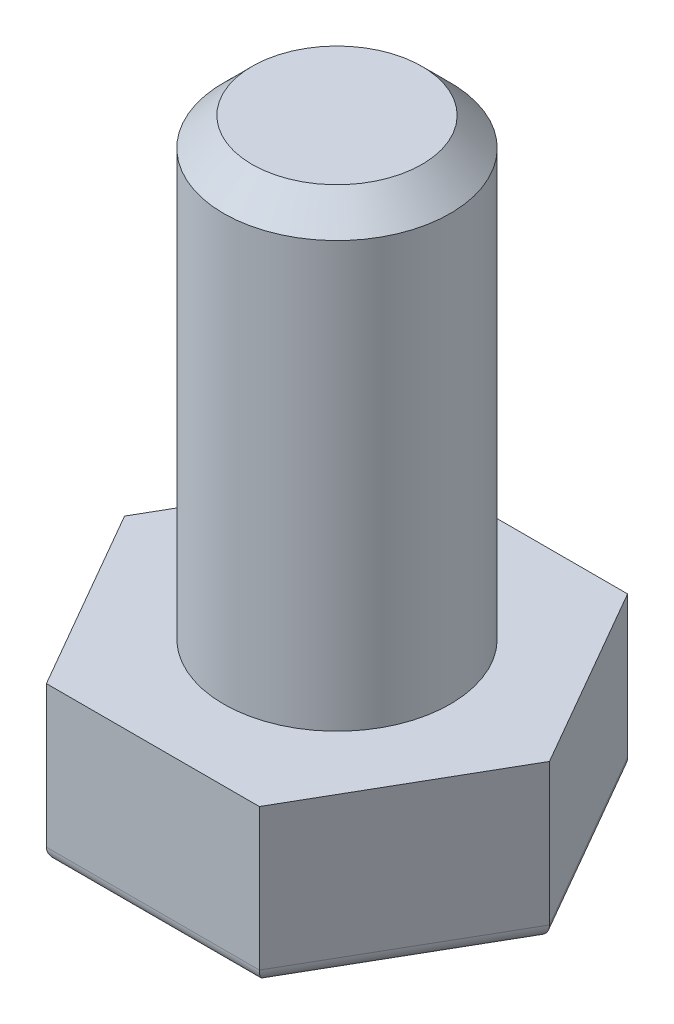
from build123d import *

# Parameters (mm, degrees)
EXTRUSION1_DEPTH = 5.5
CONG_1_R         = 0.5
ESQUISSE2_R      = 4
EXTRUSION2_DEPTH = 16
CHANFREIN1_SIZE  = 1


with BuildPart() as part:
    # Esquisse1 → Extrusion1 (new body)
    with BuildSketch(Plane(origin=(0, 0, 0), x_dir=(1, 0, 0), z_dir=(0, 1, 0))):
        Polygon((-3.758342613, 6.5), (3.758342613, 6.5), (7.5, 0), (3.758342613, -6.5), (-3.758342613, -6.5), (-7.5, 0), align=None)
    extrude(amount=EXTRUSION1_DEPTH)

    # Cong_1
    cong_1_edges = [part.edges().sort_by_distance(p)[0] for p in [
        (-5.629171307, 0, 3.25),
        (-5.629171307, 0, -3.25),
        (0, 0, -6.5),
        (5.629171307, 0, -3.25),
        (5.629171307, 0, 3.25),
        (0, 0, 6.5),
    ]]
    fillet(cong_1_edges, radius=CONG_1_R)

    # Esquisse2 → Extrusion2 (add)
    with BuildSketch(Plane(origin=(0, 5.5, 0), x_dir=(-1, 0, 0), z_dir=(0, 1, 0))):
        with Locations(Location((0, 0, 0), (0, 0, 90))):
            Circle(ESQUISSE2_R)
    extrude(amount=EXTRUSION2_DEPTH)

    # Chanfrein1
    chanfrein1_edges = [part.edges().sort_by_distance(p)[0] for p in [
        (0, 21.5, -4),
    ]]
    chamfer(chanfrein1_edges, length=CHANFREIN1_SIZE)


solid = part.part
